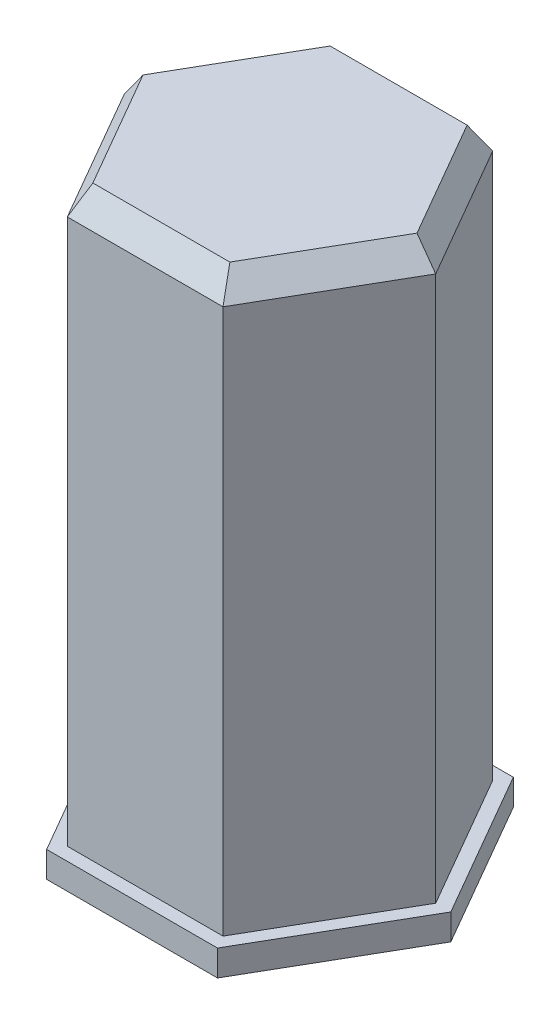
from build123d import *
from OCP.BRepFilletAPI import BRepFilletAPI_MakeChamfer

# Parameters (mm, degrees)
SKETCH1_R           = 8.25
BOSS_EXTRUDE1_DEPTH = 1
BOSS_EXTRUDE2_DEPTH = 23
CHAMFER1_SIZE       = 1
CHAMFER1_SIZE2      = 0.624869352
SKETCH2_OUTSIDE_W   = 25.052
SKETCH2_OUTSIDE_H   = 25.052
CUT_EXTRUDE1_DEPTH  = 26.790017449


with BuildPart() as part:
    # Sketch1 → Boss-Extrude1 (new body)
    with BuildSketch(Plane(origin=(0, 0, 0), x_dir=(1, 0, 0), z_dir=(0, 1, 0))):
        with Locations(Location((0, 0, 0), (0, 0, 270))):
            Circle(SKETCH1_R)
    extrude(amount=BOSS_EXTRUDE1_DEPTH)

    # Sketch1_3 → Boss-Extrude2 (add)
    with BuildSketch(Plane(origin=(0, 0, 0), x_dir=(1, 0, 0), z_dir=(0, 1, 0))):
        Polygon((3, 5.196152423), (-3, 5.196152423), (-6, 0), (-3, -5.196152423), (3, -5.196152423), (6, 0), align=None)
    extrude(amount=BOSS_EXTRUDE2_DEPTH)

    # Chamfer1: one chamfer whose edges measure the first distance from different faces: ONE call of the kernel's chamfer builder (chamfer() names one face for all edges)
    chamfer1_edges_1 = [part.edges().sort_by_distance(p)[0] for p in [
        (4.5, 23, 2.598076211),
    ]]
    chamfer1_side_1 = [part.faces().sort_by_distance(p)[0] for p in [
        (4.5, 12, 2.598076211),
    ]]
    chamfer1_edges_2 = [part.edges().sort_by_distance(p)[0] for p in [
        (4.5, 23, -2.598076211),
    ]]
    chamfer1_side_2 = [part.faces().sort_by_distance(p)[0] for p in [
        (4.5, 12, -2.598076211),
    ]]
    chamfer1_edges_3 = [part.edges().sort_by_distance(p)[0] for p in [
        (0, 23, -5.196152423),
    ]]
    chamfer1_side_3 = [part.faces().sort_by_distance(p)[0] for p in [
        (0, 12, -5.196152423),
    ]]
    chamfer1_edges_4 = [part.edges().sort_by_distance(p)[0] for p in [
        (-4.5, 23, -2.598076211),
    ]]
    chamfer1_side_4 = [part.faces().sort_by_distance(p)[0] for p in [
        (-4.5, 12, -2.598076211),
    ]]
    chamfer1_edges_5 = [part.edges().sort_by_distance(p)[0] for p in [
        (-4.5, 23, 2.598076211),
    ]]
    chamfer1_side_5 = [part.faces().sort_by_distance(p)[0] for p in [
        (-4.5, 12, 2.598076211),
    ]]
    chamfer1_edges_6 = [part.edges().sort_by_distance(p)[0] for p in [
        (0, 23, 5.196152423),
    ]]
    chamfer1_side_6 = [part.faces().sort_by_distance(p)[0] for p in [
        (0, 12, 5.196152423),
    ]]
    chamfer1 = BRepFilletAPI_MakeChamfer(part.part.solid().wrapped)
    for e in chamfer1_edges_1:
        chamfer1.Add(CHAMFER1_SIZE, CHAMFER1_SIZE2, e.wrapped, chamfer1_side_1[0].wrapped)  # the first distance lies on this face
    for e in chamfer1_edges_2:
        chamfer1.Add(CHAMFER1_SIZE, CHAMFER1_SIZE2, e.wrapped, chamfer1_side_2[0].wrapped)  # the first distance lies on this face
    for e in chamfer1_edges_3:
        chamfer1.Add(CHAMFER1_SIZE, CHAMFER1_SIZE2, e.wrapped, chamfer1_side_3[0].wrapped)  # the first distance lies on this face
    for e in chamfer1_edges_4:
        chamfer1.Add(CHAMFER1_SIZE, CHAMFER1_SIZE2, e.wrapped, chamfer1_side_4[0].wrapped)  # the first distance lies on this face
    for e in chamfer1_edges_5:
        chamfer1.Add(CHAMFER1_SIZE, CHAMFER1_SIZE2, e.wrapped, chamfer1_side_5[0].wrapped)  # the first distance lies on this face
    for e in chamfer1_edges_6:
        chamfer1.Add(CHAMFER1_SIZE, CHAMFER1_SIZE2, e.wrapped, chamfer1_side_6[0].wrapped)  # the first distance lies on this face
    add(Compound.cast(chamfer1.Shape()), mode=Mode.REPLACE)

    # Sketch2 outside → Cut-Extrude1 (cut, through all)
    with BuildSketch(Plane.XZ):
        Rectangle(SKETCH2_OUTSIDE_W, SKETCH2_OUTSIDE_H)
        Polygon((3.290896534, 5.7), (-3.290896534, 5.7), (-6.581793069, 0), (-3.290896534, -5.7), (3.290896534, -5.7), (6.581793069, 0), align=None, mode=Mode.SUBTRACT)
    extrude(amount=-CUT_EXTRUDE1_DEPTH, mode=Mode.SUBTRACT)


solid = part.part
